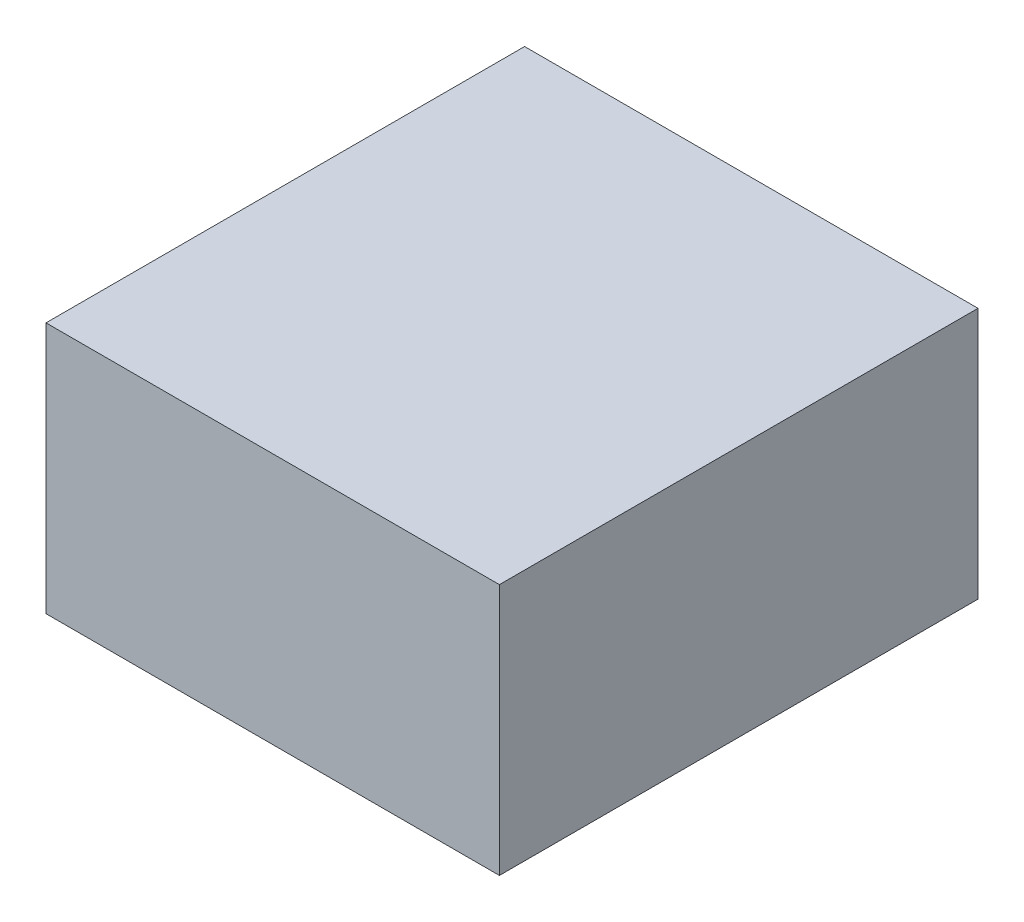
from build123d import *

# Parameters (mm, degrees)
SKETCH1_W           = 90
SKETCH1_H           = 50
BOSS_EXTRUDE1_DEPTH = 95


with BuildPart() as part:
    # Sketch1 → Boss-Extrude1 (new body)
    with BuildSketch(Plane.XY):
        Rectangle(SKETCH1_W, SKETCH1_H)
    extrude(amount=BOSS_EXTRUDE1_DEPTH)


solid = part.part
